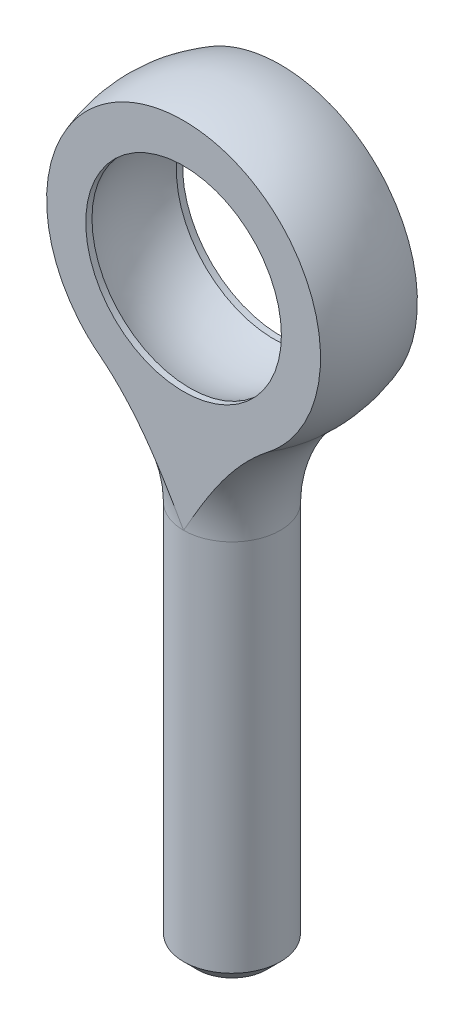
from build123d import *

# Parameters (mm, degrees)
SKETCH1_W               = 3.175
SKETCH1_H               = 25.4
CHAMFER2_SIZE           = 0.90678
CUT_EXTRUDE1_DEPTH      = 29.750847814
CUT_EXTRUDE1_DEPTH_BACK = 29.750847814
CUT_EXTRUDE2_DEPTH      = 28.312382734
CUT_EXTRUDE2_DEPTH_BACK = 28.312382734
SKETCH6_R               = 6.4135


with BuildPart() as part:
    # Sketch1 → Revolve1 (revolve)
    with BuildSketch(Plane.XY, mode=Mode.PRIVATE) as revolve1_sk:
        with Locations((1.5875, -12.7)):
            Rectangle(SKETCH1_W, SKETCH1_H)
    revolve(revolve1_sk.sketch.rotate(Axis((0, 23.8125, 0), (0, -1, 0)), 180), axis=Axis((0, 23.8125, 0), (0, -1, 0)))

    # Chamfer2
    chamfer2_edges = [part.edges().sort_by_distance(p)[0] for p in [
        (3.175, -25.4, 0),
    ]]
    chamfer(chamfer2_edges, length=CHAMFER2_SIZE)

    # Sketch4 → Revolve2 (revolve)
    with BuildSketch(Plane.XY):
        with BuildLine():
            Line((3.175, 0), (0, 0))
            Line((0, 0), (0, 23.8125))
            ThreePointArc((0, 23.8125), (8.890116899, 17.70677573), (6.382731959, 7.217396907))
            ThreePointArc((6.382731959, 7.217396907), (4.01304802, 3.949061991), (3.175, 0))
        make_face()
    revolve(axis=Axis((0, 23.8125, 0), (0, 1, 0)))

    # Sketch5 → Cut-Extrude1 (cut, two sides: drawn at the far end of the back side and taken through both)
    with BuildSketch(Plane(origin=(0, 0, 0), x_dir=(0, 0, -1), z_dir=(1, 0, 0)).offset(-CUT_EXTRUDE1_DEPTH_BACK)):
        Polygon((3.175, 23.8125), (9.525, 23.8125), (9.525, 0), (3.175, 0), (3.175, 1.27), align=None)
        Polygon((-3.175, 23.8125), (-3.175, 1.27), (-3.175, 0), (-9.525, 0), (-9.525, 23.8125), align=None)
    extrude(amount=CUT_EXTRUDE1_DEPTH + CUT_EXTRUDE1_DEPTH_BACK, mode=Mode.SUBTRACT)

    # Sketch6 → Cut-Extrude2 (cut, two sides: drawn at the far end of the back side and taken through both)
    with BuildSketch(Plane.XY.offset(-CUT_EXTRUDE2_DEPTH_BACK)):
        with Locations((0, 14.2875)):
            Circle(SKETCH6_R)
    extrude(amount=CUT_EXTRUDE2_DEPTH + CUT_EXTRUDE2_DEPTH_BACK, mode=Mode.SUBTRACT)

    # Sketch14 → Cut-Revolve1 (revolve, cut)
    with BuildSketch(Plane.XY):
        with BuildLine():
            Line((0, 21.2725), (0, 7.3025))
            ThreePointArc((0, 7.3025), (6.985, 14.2875), (0, 21.2725))
        make_face()
    revolve(axis=Axis((0, 21.2725, 0), (0, -1, 0)), mode=Mode.SUBTRACT)


solid = part.part
